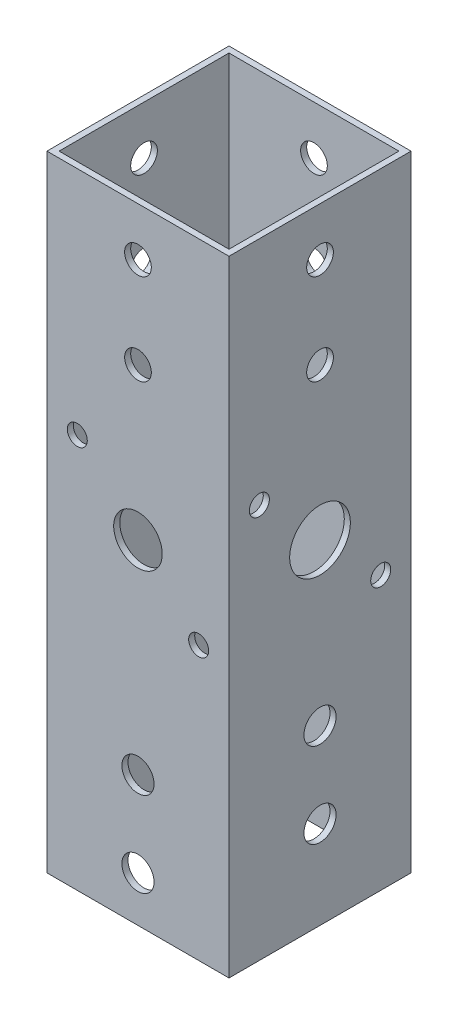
ISO-10303-21;
HEADER;
FILE_DESCRIPTION(('STEP AP214'),'2;1');
FILE_NAME('part.step','',(''),(''),'','','');
FILE_SCHEMA(('AUTOMOTIVE_DESIGN { 1 0 10303 214 1 1 1 1 }'));
ENDSEC;
DATA;
#1=APPLICATION_CONTEXT('core data for automotive mechanical design processes');
#2=APPLICATION_PROTOCOL_DEFINITION('international standard','automotive_design',2000,#1);
#3=PRODUCT_CONTEXT('',#1,'mechanical');
#4=PRODUCT('Part','Part','',(#3));
#5=PRODUCT_RELATED_PRODUCT_CATEGORY('part','',(#4));
#6=PRODUCT_DEFINITION_FORMATION('','',#4);
#7=PRODUCT_DEFINITION_CONTEXT('part definition',#1,'design');
#8=PRODUCT_DEFINITION('design','',#6,#7);
#9=PRODUCT_DEFINITION_SHAPE('','',#8);
#10=(LENGTH_UNIT() NAMED_UNIT(*) SI_UNIT(.MILLI.,.METRE.));
#11=(NAMED_UNIT(*) PLANE_ANGLE_UNIT() SI_UNIT($,.RADIAN.));
#12=(NAMED_UNIT(*) SI_UNIT($,.STERADIAN.) SOLID_ANGLE_UNIT());
#13=UNCERTAINTY_MEASURE_WITH_UNIT(LENGTH_MEASURE(1.E-05),#10,'distance_accuracy_value','');
#14=(GEOMETRIC_REPRESENTATION_CONTEXT(3) GLOBAL_UNCERTAINTY_ASSIGNED_CONTEXT((#13)) GLOBAL_UNIT_ASSIGNED_CONTEXT((#10,
#11,#12)) REPRESENTATION_CONTEXT('',''));
#15=CARTESIAN_POINT('',(0.,0.,0.));
#16=DIRECTION('',(0.,0.,1.));
#17=DIRECTION('',(1.,0.,0.));
#18=AXIS2_PLACEMENT_3D('',#15,#16,#17);
#19=CARTESIAN_POINT('',(0.,-3.,0.));
#20=DIRECTION('',(0.,1.,0.));
#21=DIRECTION('',(1.,0.,0.));
#22=AXIS2_PLACEMENT_3D('',#19,#20,#21);
#23=PLANE('',#22);
#24=DIRECTION('',(0.,0.,1.));
#25=VECTOR('',#24,1.);
#26=CARTESIAN_POINT('',(14.,-3.,-14.));
#27=LINE('',#26,#25);
#28=CARTESIAN_POINT('',(14.,-3.,-14.));
#29=VERTEX_POINT('',#28);
#30=CARTESIAN_POINT('',(14.,-3.,14.));
#31=VERTEX_POINT('',#30);
#32=EDGE_CURVE('E208',#29,#31,#27,.T.);
#33=ORIENTED_EDGE('',*,*,#32,.F.);
#34=DIRECTION('',(1.,0.,0.));
#35=VECTOR('',#34,1.);
#36=CARTESIAN_POINT('',(-14.,-3.,-14.));
#37=LINE('',#36,#35);
#38=CARTESIAN_POINT('',(-14.,-3.,-14.));
#39=VERTEX_POINT('',#38);
#40=EDGE_CURVE('E49',#39,#29,#37,.T.);
#41=ORIENTED_EDGE('',*,*,#40,.F.);
#42=DIRECTION('',(0.,0.,-1.));
#43=VECTOR('',#42,1.);
#44=CARTESIAN_POINT('',(-14.,-3.,-14.));
#45=LINE('',#44,#43);
#46=CARTESIAN_POINT('',(-14.,-3.,14.));
#47=VERTEX_POINT('',#46);
#48=EDGE_CURVE('E224',#47,#39,#45,.T.);
#49=ORIENTED_EDGE('',*,*,#48,.F.);
#50=DIRECTION('',(-1.,0.,0.));
#51=VECTOR('',#50,1.);
#52=CARTESIAN_POINT('',(-14.,-3.,14.));
#53=LINE('',#52,#51);
#54=EDGE_CURVE('E25',#31,#47,#53,.T.);
#55=ORIENTED_EDGE('',*,*,#54,.F.);
#56=EDGE_LOOP('',(#33,#41,#49,#55));
#57=FACE_BOUND('',#56,.T.);
#58=DIRECTION('',(0.,0.,1.));
#59=VECTOR('',#58,1.);
#60=CARTESIAN_POINT('',(15.,-3.,-15.));
#61=LINE('',#60,#59);
#62=CARTESIAN_POINT('',(15.,-3.,-15.));
#63=VERTEX_POINT('',#62);
#64=CARTESIAN_POINT('',(15.,-3.,15.));
#65=VERTEX_POINT('',#64);
#66=EDGE_CURVE('E112',#63,#65,#61,.T.);
#67=ORIENTED_EDGE('',*,*,#66,.T.);
#68=DIRECTION('',(-1.,0.,0.));
#69=VECTOR('',#68,1.);
#70=CARTESIAN_POINT('',(-15.,-3.,15.));
#71=LINE('',#70,#69);
#72=CARTESIAN_POINT('',(-15.,-3.,15.));
#73=VERTEX_POINT('',#72);
#74=EDGE_CURVE('E106',#65,#73,#71,.T.);
#75=ORIENTED_EDGE('',*,*,#74,.T.);
#76=DIRECTION('',(0.,0.,-1.));
#77=VECTOR('',#76,1.);
#78=CARTESIAN_POINT('',(-15.,-3.,-15.));
#79=LINE('',#78,#77);
#80=CARTESIAN_POINT('',(-15.,-3.,-15.));
#81=VERTEX_POINT('',#80);
#82=EDGE_CURVE('E109',#73,#81,#79,.T.);
#83=ORIENTED_EDGE('',*,*,#82,.T.);
#84=DIRECTION('',(1.,0.,0.));
#85=VECTOR('',#84,1.);
#86=CARTESIAN_POINT('',(-15.,-3.,-15.));
#87=LINE('',#86,#85);
#88=EDGE_CURVE('E235',#81,#63,#87,.T.);
#89=ORIENTED_EDGE('',*,*,#88,.T.);
#90=EDGE_LOOP('',(#67,#75,#83,#89));
#91=FACE_BOUND('',#90,.T.);
#92=ADVANCED_FACE('F17',(#57,#91),#23,.F.);
#93=CARTESIAN_POINT('',(0.,100.,0.));
#94=DIRECTION('',(0.,-1.,0.));
#95=DIRECTION('',(0.,0.,-1.));
#96=AXIS2_PLACEMENT_3D('',#93,#94,#95);
#97=PLANE('',#96);
#98=DIRECTION('',(0.,0.,-1.));
#99=VECTOR('',#98,1.);
#100=CARTESIAN_POINT('',(14.,100.,14.));
#101=LINE('',#100,#99);
#102=CARTESIAN_POINT('',(14.,100.,14.));
#103=VERTEX_POINT('',#102);
#104=CARTESIAN_POINT('',(14.,100.,-14.));
#105=VERTEX_POINT('',#104);
#106=EDGE_CURVE('E216',#103,#105,#101,.T.);
#107=ORIENTED_EDGE('',*,*,#106,.F.);
#108=DIRECTION('',(1.,0.,0.));
#109=VECTOR('',#108,1.);
#110=CARTESIAN_POINT('',(-14.,100.,14.));
#111=LINE('',#110,#109);
#112=CARTESIAN_POINT('',(-14.,100.,14.));
#113=VERTEX_POINT('',#112);
#114=EDGE_CURVE('E11',#113,#103,#111,.T.);
#115=ORIENTED_EDGE('',*,*,#114,.F.);
#116=DIRECTION('',(0.,0.,1.));
#117=VECTOR('',#116,1.);
#118=CARTESIAN_POINT('',(-14.,100.,14.));
#119=LINE('',#118,#117);
#120=CARTESIAN_POINT('',(-14.,100.,-14.));
#121=VERTEX_POINT('',#120);
#122=EDGE_CURVE('E231',#121,#113,#119,.T.);
#123=ORIENTED_EDGE('',*,*,#122,.F.);
#124=DIRECTION('',(-1.,0.,0.));
#125=VECTOR('',#124,1.);
#126=CARTESIAN_POINT('',(-14.,100.,-14.));
#127=LINE('',#126,#125);
#128=EDGE_CURVE('E38',#105,#121,#127,.T.);
#129=ORIENTED_EDGE('',*,*,#128,.F.);
#130=EDGE_LOOP('',(#107,#115,#123,#129));
#131=FACE_BOUND('',#130,.T.);
#132=DIRECTION('',(0.,0.,-1.));
#133=VECTOR('',#132,1.);
#134=CARTESIAN_POINT('',(15.,100.,15.));
#135=LINE('',#134,#133);
#136=CARTESIAN_POINT('',(15.,100.,15.));
#137=VERTEX_POINT('',#136);
#138=CARTESIAN_POINT('',(15.,100.,-15.));
#139=VERTEX_POINT('',#138);
#140=EDGE_CURVE('E138',#137,#139,#135,.T.);
#141=ORIENTED_EDGE('',*,*,#140,.T.);
#142=DIRECTION('',(-1.,0.,0.));
#143=VECTOR('',#142,1.);
#144=CARTESIAN_POINT('',(-15.,100.,-15.));
#145=LINE('',#144,#143);
#146=CARTESIAN_POINT('',(-15.,100.,-15.));
#147=VERTEX_POINT('',#146);
#148=EDGE_CURVE('E118',#139,#147,#145,.T.);
#149=ORIENTED_EDGE('',*,*,#148,.T.);
#150=DIRECTION('',(0.,0.,1.));
#151=VECTOR('',#150,1.);
#152=CARTESIAN_POINT('',(-15.,100.,15.));
#153=LINE('',#152,#151);
#154=CARTESIAN_POINT('',(-15.,100.,15.));
#155=VERTEX_POINT('',#154);
#156=EDGE_CURVE('E127',#147,#155,#153,.T.);
#157=ORIENTED_EDGE('',*,*,#156,.T.);
#158=DIRECTION('',(1.,0.,0.));
#159=VECTOR('',#158,1.);
#160=CARTESIAN_POINT('',(-15.,100.,15.));
#161=LINE('',#160,#159);
#162=EDGE_CURVE('E117',#155,#137,#161,.T.);
#163=ORIENTED_EDGE('',*,*,#162,.T.);
#164=EDGE_LOOP('',(#141,#149,#157,#163));
#165=FACE_BOUND('',#164,.T.);
#166=ADVANCED_FACE('F255',(#131,#165),#97,.F.);
#167=CARTESIAN_POINT('',(-14.,100.,14.));
#168=DIRECTION('',(0.,0.,-1.));
#169=DIRECTION('',(0.,-1.,0.));
#170=AXIS2_PLACEMENT_3D('',#167,#168,#169);
#171=PLANE('',#170);
#172=CARTESIAN_POINT('',(-10.,62.,14.));
#173=DIRECTION('',(0.,0.,-1.));
#174=DIRECTION('',(-1.,0.,0.));
#175=AXIS2_PLACEMENT_3D('',#172,#173,#174);
#176=CIRCLE('',#175,1.65);
#177=CARTESIAN_POINT('',(-11.65,62.,14.));
#178=VERTEX_POINT('',#177);
#179=EDGE_CURVE('E446',#178,#178,#176,.T.);
#180=ORIENTED_EDGE('',*,*,#179,.F.);
#181=EDGE_LOOP('',(#180));
#182=FACE_BOUND('',#181,.T.);
#183=CARTESIAN_POINT('',(0.,18.5,14.));
#184=DIRECTION('',(0.,0.,-1.));
#185=DIRECTION('',(-1.,0.,0.));
#186=AXIS2_PLACEMENT_3D('',#183,#184,#185);
#187=CIRCLE('',#186,2.65);
#188=CARTESIAN_POINT('',(-2.65,18.5,14.));
#189=VERTEX_POINT('',#188);
#190=EDGE_CURVE('E168',#189,#189,#187,.T.);
#191=ORIENTED_EDGE('',*,*,#190,.F.);
#192=EDGE_LOOP('',(#191));
#193=FACE_BOUND('',#192,.T.);
#194=CARTESIAN_POINT('',(0.,92.,14.));
#195=DIRECTION('',(0.,0.,-1.));
#196=DIRECTION('',(-1.,0.,0.));
#197=AXIS2_PLACEMENT_3D('',#194,#195,#196);
#198=CIRCLE('',#197,2.2);
#199=CARTESIAN_POINT('',(-2.2,92.,14.));
#200=VERTEX_POINT('',#199);
#201=EDGE_CURVE('E149',#200,#200,#198,.T.);
#202=ORIENTED_EDGE('',*,*,#201,.F.);
#203=EDGE_LOOP('',(#202));
#204=FACE_BOUND('',#203,.T.);
#205=CARTESIAN_POINT('',(0.,77.,14.));
#206=DIRECTION('',(0.,0.,-1.));
#207=DIRECTION('',(-1.,0.,0.));
#208=AXIS2_PLACEMENT_3D('',#205,#206,#207);
#209=CIRCLE('',#208,2.2);
#210=CARTESIAN_POINT('',(-2.2,77.,14.));
#211=VERTEX_POINT('',#210);
#212=EDGE_CURVE('E176',#211,#211,#209,.T.);
#213=ORIENTED_EDGE('',*,*,#212,.F.);
#214=EDGE_LOOP('',(#213));
#215=FACE_BOUND('',#214,.T.);
#216=CARTESIAN_POINT('',(0.,4.5,14.));
#217=DIRECTION('',(0.,0.,-1.));
#218=DIRECTION('',(-1.,0.,0.));
#219=AXIS2_PLACEMENT_3D('',#216,#217,#218);
#220=CIRCLE('',#219,2.65);
#221=CARTESIAN_POINT('',(-2.65,4.5,14.));
#222=VERTEX_POINT('',#221);
#223=EDGE_CURVE('E187',#222,#222,#220,.T.);
#224=ORIENTED_EDGE('',*,*,#223,.F.);
#225=EDGE_LOOP('',(#224));
#226=FACE_BOUND('',#225,.T.);
#227=CARTESIAN_POINT('',(10.,42.,14.));
#228=DIRECTION('',(0.,0.,1.));
#229=DIRECTION('',(-1.,0.,0.));
#230=AXIS2_PLACEMENT_3D('',#227,#228,#229);
#231=CIRCLE('',#230,1.65);
#232=CARTESIAN_POINT('',(8.35,42.,14.));
#233=VERTEX_POINT('',#232);
#234=EDGE_CURVE('E445',#233,#233,#231,.T.);
#235=ORIENTED_EDGE('',*,*,#234,.T.);
#236=EDGE_LOOP('',(#235));
#237=FACE_BOUND('',#236,.T.);
#238=CARTESIAN_POINT('',(0.,52.,14.));
#239=DIRECTION('',(0.,0.,-1.));
#240=DIRECTION('',(-1.,0.,0.));
#241=AXIS2_PLACEMENT_3D('',#238,#239,#240);
#242=CIRCLE('',#241,4.);
#243=CARTESIAN_POINT('',(-4.,52.,14.));
#244=VERTEX_POINT('',#243);
#245=EDGE_CURVE('E410',#244,#244,#242,.T.);
#246=ORIENTED_EDGE('',*,*,#245,.F.);
#247=EDGE_LOOP('',(#246));
#248=FACE_BOUND('',#247,.T.);
#249=DIRECTION('',(0.,-1.,0.));
#250=VECTOR('',#249,1.);
#251=CARTESIAN_POINT('',(14.,100.,14.));
#252=LINE('',#251,#250);
#253=EDGE_CURVE('E212',#103,#31,#252,.T.);
#254=ORIENTED_EDGE('',*,*,#253,.T.);
#255=ORIENTED_EDGE('',*,*,#54,.T.);
#256=DIRECTION('',(0.,-1.,0.));
#257=VECTOR('',#256,1.);
#258=CARTESIAN_POINT('',(-14.,100.,14.));
#259=LINE('',#258,#257);
#260=EDGE_CURVE('E220',#113,#47,#259,.T.);
#261=ORIENTED_EDGE('',*,*,#260,.F.);
#262=ORIENTED_EDGE('',*,*,#114,.T.);
#263=EDGE_LOOP('',(#254,#255,#261,#262));
#264=FACE_BOUND('',#263,.T.);
#265=ADVANCED_FACE('F248',(#182,#193,#204,#215,#226,#237,#248,#264),#171,.T.);
#266=CARTESIAN_POINT('',(-14.,100.,-14.));
#267=DIRECTION('',(0.,0.,1.));
#268=DIRECTION('',(1.,0.,0.));
#269=AXIS2_PLACEMENT_3D('',#266,#267,#268);
#270=PLANE('',#269);
#271=CARTESIAN_POINT('',(-10.,62.,-14.));
#272=DIRECTION('',(0.,0.,1.));
#273=DIRECTION('',(1.,0.,0.));
#274=AXIS2_PLACEMENT_3D('',#271,#272,#273);
#275=CIRCLE('',#274,1.65);
#276=CARTESIAN_POINT('',(-8.35,62.,-14.));
#277=VERTEX_POINT('',#276);
#278=EDGE_CURVE('E450',#277,#277,#275,.T.);
#279=ORIENTED_EDGE('',*,*,#278,.F.);
#280=EDGE_LOOP('',(#279));
#281=FACE_BOUND('',#280,.T.);
#282=CARTESIAN_POINT('',(0.,18.5,-14.));
#283=DIRECTION('',(0.,0.,1.));
#284=DIRECTION('',(1.,0.,0.));
#285=AXIS2_PLACEMENT_3D('',#282,#283,#284);
#286=CIRCLE('',#285,2.65);
#287=CARTESIAN_POINT('',(2.65,18.5,-14.));
#288=VERTEX_POINT('',#287);
#289=EDGE_CURVE('E192',#288,#288,#286,.T.);
#290=ORIENTED_EDGE('',*,*,#289,.F.);
#291=EDGE_LOOP('',(#290));
#292=FACE_BOUND('',#291,.T.);
#293=CARTESIAN_POINT('',(0.,92.,-14.));
#294=DIRECTION('',(0.,0.,1.));
#295=DIRECTION('',(1.,0.,0.));
#296=AXIS2_PLACEMENT_3D('',#293,#294,#295);
#297=CIRCLE('',#296,2.2);
#298=CARTESIAN_POINT('',(2.2,92.,-14.));
#299=VERTEX_POINT('',#298);
#300=EDGE_CURVE('E177',#299,#299,#297,.T.);
#301=ORIENTED_EDGE('',*,*,#300,.F.);
#302=EDGE_LOOP('',(#301));
#303=FACE_BOUND('',#302,.T.);
#304=CARTESIAN_POINT('',(0.,77.,-14.));
#305=DIRECTION('',(0.,0.,1.));
#306=DIRECTION('',(1.,0.,0.));
#307=AXIS2_PLACEMENT_3D('',#304,#305,#306);
#308=CIRCLE('',#307,2.2);
#309=CARTESIAN_POINT('',(2.2,77.,-14.));
#310=VERTEX_POINT('',#309);
#311=EDGE_CURVE('E335',#310,#310,#308,.T.);
#312=ORIENTED_EDGE('',*,*,#311,.F.);
#313=EDGE_LOOP('',(#312));
#314=FACE_BOUND('',#313,.T.);
#315=CARTESIAN_POINT('',(0.,4.5,-14.));
#316=DIRECTION('',(0.,0.,1.));
#317=DIRECTION('',(1.,0.,0.));
#318=AXIS2_PLACEMENT_3D('',#315,#316,#317);
#319=CIRCLE('',#318,2.65);
#320=CARTESIAN_POINT('',(2.65,4.5,-14.));
#321=VERTEX_POINT('',#320);
#322=EDGE_CURVE('E162',#321,#321,#319,.T.);
#323=ORIENTED_EDGE('',*,*,#322,.F.);
#324=EDGE_LOOP('',(#323));
#325=FACE_BOUND('',#324,.T.);
#326=CARTESIAN_POINT('',(10.,42.,-14.));
#327=DIRECTION('',(0.,0.,-1.));
#328=DIRECTION('',(1.,0.,0.));
#329=AXIS2_PLACEMENT_3D('',#326,#327,#328);
#330=CIRCLE('',#329,1.65);
#331=CARTESIAN_POINT('',(11.65,42.,-14.));
#332=VERTEX_POINT('',#331);
#333=EDGE_CURVE('E449',#332,#332,#330,.T.);
#334=ORIENTED_EDGE('',*,*,#333,.T.);
#335=EDGE_LOOP('',(#334));
#336=FACE_BOUND('',#335,.T.);
#337=DIRECTION('',(0.,-1.,0.));
#338=VECTOR('',#337,1.);
#339=CARTESIAN_POINT('',(-14.,100.,-14.));
#340=LINE('',#339,#338);
#341=EDGE_CURVE('E228',#121,#39,#340,.T.);
#342=ORIENTED_EDGE('',*,*,#341,.T.);
#343=ORIENTED_EDGE('',*,*,#40,.T.);
#344=DIRECTION('',(0.,-1.,0.));
#345=VECTOR('',#344,1.);
#346=CARTESIAN_POINT('',(14.,100.,-14.));
#347=LINE('',#346,#345);
#348=EDGE_CURVE('E204',#105,#29,#347,.T.);
#349=ORIENTED_EDGE('',*,*,#348,.F.);
#350=ORIENTED_EDGE('',*,*,#128,.T.);
#351=EDGE_LOOP('',(#342,#343,#349,#350));
#352=FACE_BOUND('',#351,.T.);
#353=ADVANCED_FACE('F259',(#281,#292,#303,#314,#325,#336,#352),#270,.T.);
#354=CARTESIAN_POINT('',(-15.,100.,15.));
#355=DIRECTION('',(0.,0.,-1.));
#356=DIRECTION('',(0.,-1.,0.));
#357=AXIS2_PLACEMENT_3D('',#354,#355,#356);
#358=PLANE('',#357);
#359=CARTESIAN_POINT('',(-10.,62.,15.));
#360=DIRECTION('',(0.,0.,1.));
#361=DIRECTION('',(1.,0.,0.));
#362=AXIS2_PLACEMENT_3D('',#359,#360,#361);
#363=CIRCLE('',#362,1.65);
#364=CARTESIAN_POINT('',(-8.35,62.,15.));
#365=VERTEX_POINT('',#364);
#366=EDGE_CURVE('E441',#365,#365,#363,.T.);
#367=ORIENTED_EDGE('',*,*,#366,.F.);
#368=EDGE_LOOP('',(#367));
#369=FACE_BOUND('',#368,.T.);
#370=CARTESIAN_POINT('',(10.,42.,15.));
#371=DIRECTION('',(0.,0.,-1.));
#372=DIRECTION('',(1.,0.,0.));
#373=AXIS2_PLACEMENT_3D('',#370,#371,#372);
#374=CIRCLE('',#373,1.65);
#375=CARTESIAN_POINT('',(11.65,42.,15.));
#376=VERTEX_POINT('',#375);
#377=EDGE_CURVE('E358',#376,#376,#374,.T.);
#378=ORIENTED_EDGE('',*,*,#377,.T.);
#379=EDGE_LOOP('',(#378));
#380=FACE_BOUND('',#379,.T.);
#381=CARTESIAN_POINT('',(0.,4.5,15.));
#382=DIRECTION('',(0.,0.,1.));
#383=DIRECTION('',(1.,0.,0.));
#384=AXIS2_PLACEMENT_3D('',#381,#382,#383);
#385=CIRCLE('',#384,2.65);
#386=CARTESIAN_POINT('',(2.65,4.5,15.));
#387=VERTEX_POINT('',#386);
#388=EDGE_CURVE('E191',#387,#387,#385,.T.);
#389=ORIENTED_EDGE('',*,*,#388,.F.);
#390=EDGE_LOOP('',(#389));
#391=FACE_BOUND('',#390,.T.);
#392=CARTESIAN_POINT('',(0.,77.,15.));
#393=DIRECTION('',(0.,0.,1.));
#394=DIRECTION('',(1.,0.,0.));
#395=AXIS2_PLACEMENT_3D('',#392,#393,#394);
#396=CIRCLE('',#395,2.2);
#397=CARTESIAN_POINT('',(2.2,77.,15.));
#398=VERTEX_POINT('',#397);
#399=EDGE_CURVE('E154',#398,#398,#396,.T.);
#400=ORIENTED_EDGE('',*,*,#399,.F.);
#401=EDGE_LOOP('',(#400));
#402=FACE_BOUND('',#401,.T.);
#403=CARTESIAN_POINT('',(0.,92.,15.));
#404=DIRECTION('',(0.,0.,1.));
#405=DIRECTION('',(1.,0.,0.));
#406=AXIS2_PLACEMENT_3D('',#403,#404,#405);
#407=CIRCLE('',#406,2.2);
#408=CARTESIAN_POINT('',(2.2,92.,15.));
#409=VERTEX_POINT('',#408);
#410=EDGE_CURVE('E153',#409,#409,#407,.T.);
#411=ORIENTED_EDGE('',*,*,#410,.F.);
#412=EDGE_LOOP('',(#411));
#413=FACE_BOUND('',#412,.T.);
#414=CARTESIAN_POINT('',(0.,18.5,15.));
#415=DIRECTION('',(0.,0.,1.));
#416=DIRECTION('',(1.,0.,0.));
#417=AXIS2_PLACEMENT_3D('',#414,#415,#416);
#418=CIRCLE('',#417,2.65);
#419=CARTESIAN_POINT('',(2.65,18.5,15.));
#420=VERTEX_POINT('',#419);
#421=EDGE_CURVE('E163',#420,#420,#418,.T.);
#422=ORIENTED_EDGE('',*,*,#421,.F.);
#423=EDGE_LOOP('',(#422));
#424=FACE_BOUND('',#423,.T.);
#425=CARTESIAN_POINT('',(0.,52.,15.));
#426=DIRECTION('',(0.,0.,1.));
#427=DIRECTION('',(1.,0.,0.));
#428=AXIS2_PLACEMENT_3D('',#425,#426,#427);
#429=CIRCLE('',#428,4.);
#430=CARTESIAN_POINT('',(4.,52.,15.));
#431=VERTEX_POINT('',#430);
#432=EDGE_CURVE('E418',#431,#431,#429,.T.);
#433=ORIENTED_EDGE('',*,*,#432,.F.);
#434=EDGE_LOOP('',(#433));
#435=FACE_BOUND('',#434,.T.);
#436=DIRECTION('',(0.,-1.,0.));
#437=VECTOR('',#436,1.);
#438=CARTESIAN_POINT('',(-15.,100.,15.));
#439=LINE('',#438,#437);
#440=EDGE_CURVE('E121',#155,#73,#439,.T.);
#441=ORIENTED_EDGE('',*,*,#440,.T.);
#442=ORIENTED_EDGE('',*,*,#74,.F.);
#443=DIRECTION('',(0.,-1.,0.));
#444=VECTOR('',#443,1.);
#445=CARTESIAN_POINT('',(15.,100.,15.));
#446=LINE('',#445,#444);
#447=EDGE_CURVE('E167',#137,#65,#446,.T.);
#448=ORIENTED_EDGE('',*,*,#447,.F.);
#449=ORIENTED_EDGE('',*,*,#162,.F.);
#450=EDGE_LOOP('',(#441,#442,#448,#449));
#451=FACE_BOUND('',#450,.T.);
#452=ADVANCED_FACE('F122',(#369,#380,#391,#402,#413,#424,#435,#451),#358,.F.);
#453=CARTESIAN_POINT('',(-15.,100.,-15.));
#454=DIRECTION('',(0.,0.,1.));
#455=DIRECTION('',(1.,0.,0.));
#456=AXIS2_PLACEMENT_3D('',#453,#454,#455);
#457=PLANE('',#456);
#458=CARTESIAN_POINT('',(-10.,62.,-15.));
#459=DIRECTION('',(0.,0.,1.));
#460=DIRECTION('',(1.,0.,0.));
#461=AXIS2_PLACEMENT_3D('',#458,#459,#460);
#462=CIRCLE('',#461,1.65);
#463=CARTESIAN_POINT('',(-8.35,62.,-15.));
#464=VERTEX_POINT('',#463);
#465=EDGE_CURVE('E302',#464,#464,#462,.T.);
#466=ORIENTED_EDGE('',*,*,#465,.T.);
#467=EDGE_LOOP('',(#466));
#468=FACE_BOUND('',#467,.T.);
#469=CARTESIAN_POINT('',(10.,42.,-15.));
#470=DIRECTION('',(0.,0.,-1.));
#471=DIRECTION('',(1.,0.,0.));
#472=AXIS2_PLACEMENT_3D('',#469,#470,#471);
#473=CIRCLE('',#472,1.65);
#474=CARTESIAN_POINT('',(11.65,42.,-15.));
#475=VERTEX_POINT('',#474);
#476=EDGE_CURVE('E306',#475,#475,#473,.T.);
#477=ORIENTED_EDGE('',*,*,#476,.F.);
#478=EDGE_LOOP('',(#477));
#479=FACE_BOUND('',#478,.T.);
#480=CARTESIAN_POINT('',(0.,4.5,-15.));
#481=DIRECTION('',(0.,0.,1.));
#482=DIRECTION('',(1.,0.,0.));
#483=AXIS2_PLACEMENT_3D('',#480,#481,#482);
#484=CIRCLE('',#483,2.65);
#485=CARTESIAN_POINT('',(2.65,4.5,-15.));
#486=VERTEX_POINT('',#485);
#487=EDGE_CURVE('E158',#486,#486,#484,.T.);
#488=ORIENTED_EDGE('',*,*,#487,.T.);
#489=EDGE_LOOP('',(#488));
#490=FACE_BOUND('',#489,.T.);
#491=CARTESIAN_POINT('',(0.,77.,-15.));
#492=DIRECTION('',(0.,0.,1.));
#493=DIRECTION('',(1.,0.,0.));
#494=AXIS2_PLACEMENT_3D('',#491,#492,#493);
#495=CIRCLE('',#494,2.2);
#496=CARTESIAN_POINT('',(2.2,77.,-15.));
#497=VERTEX_POINT('',#496);
#498=EDGE_CURVE('E172',#497,#497,#495,.T.);
#499=ORIENTED_EDGE('',*,*,#498,.T.);
#500=EDGE_LOOP('',(#499));
#501=FACE_BOUND('',#500,.T.);
#502=CARTESIAN_POINT('',(0.,92.,-15.));
#503=DIRECTION('',(0.,0.,1.));
#504=DIRECTION('',(1.,0.,0.));
#505=AXIS2_PLACEMENT_3D('',#502,#503,#504);
#506=CIRCLE('',#505,2.2);
#507=CARTESIAN_POINT('',(2.2,92.,-15.));
#508=VERTEX_POINT('',#507);
#509=EDGE_CURVE('E182',#508,#508,#506,.T.);
#510=ORIENTED_EDGE('',*,*,#509,.T.);
#511=EDGE_LOOP('',(#510));
#512=FACE_BOUND('',#511,.T.);
#513=CARTESIAN_POINT('',(0.,18.5,-15.));
#514=DIRECTION('',(0.,0.,1.));
#515=DIRECTION('',(1.,0.,0.));
#516=AXIS2_PLACEMENT_3D('',#513,#514,#515);
#517=CIRCLE('',#516,2.65);
#518=CARTESIAN_POINT('',(2.65,18.5,-15.));
#519=VERTEX_POINT('',#518);
#520=EDGE_CURVE('E181',#519,#519,#517,.T.);
#521=ORIENTED_EDGE('',*,*,#520,.T.);
#522=EDGE_LOOP('',(#521));
#523=FACE_BOUND('',#522,.T.);
#524=DIRECTION('',(0.,-1.,0.));
#525=VECTOR('',#524,1.);
#526=CARTESIAN_POINT('',(15.,100.,-15.));
#527=LINE('',#526,#525);
#528=EDGE_CURVE('E186',#139,#63,#527,.T.);
#529=ORIENTED_EDGE('',*,*,#528,.T.);
#530=ORIENTED_EDGE('',*,*,#88,.F.);
#531=DIRECTION('',(0.,-1.,0.));
#532=VECTOR('',#531,1.);
#533=CARTESIAN_POINT('',(-15.,100.,-15.));
#534=LINE('',#533,#532);
#535=EDGE_CURVE('E131',#147,#81,#534,.T.);
#536=ORIENTED_EDGE('',*,*,#535,.F.);
#537=ORIENTED_EDGE('',*,*,#148,.F.);
#538=EDGE_LOOP('',(#529,#530,#536,#537));
#539=FACE_BOUND('',#538,.T.);
#540=ADVANCED_FACE('F268',(#468,#479,#490,#501,#512,#523,#539),#457,.F.);
#541=CARTESIAN_POINT('',(-14.,100.,14.));
#542=DIRECTION('',(1.,0.,0.));
#543=DIRECTION('',(0.,1.,0.));
#544=AXIS2_PLACEMENT_3D('',#541,#542,#543);
#545=PLANE('',#544);
#546=CARTESIAN_POINT('',(-14.,62.,10.));
#547=DIRECTION('',(1.,0.,0.));
#548=DIRECTION('',(0.,0.,-1.));
#549=AXIS2_PLACEMENT_3D('',#546,#547,#548);
#550=CIRCLE('',#549,1.65);
#551=CARTESIAN_POINT('',(-14.,62.,8.35));
#552=VERTEX_POINT('',#551);
#553=EDGE_CURVE('E430',#552,#552,#550,.T.);
#554=ORIENTED_EDGE('',*,*,#553,.F.);
#555=EDGE_LOOP('',(#554));
#556=FACE_BOUND('',#555,.T.);
#557=CARTESIAN_POINT('',(-14.,25.5,0.));
#558=DIRECTION('',(1.,0.,0.));
#559=DIRECTION('',(0.,0.,-1.));
#560=AXIS2_PLACEMENT_3D('',#557,#558,#559);
#561=CIRCLE('',#560,2.65);
#562=CARTESIAN_POINT('',(-14.,25.5,-2.65));
#563=VERTEX_POINT('',#562);
#564=EDGE_CURVE('E148',#563,#563,#561,.T.);
#565=ORIENTED_EDGE('',*,*,#564,.F.);
#566=EDGE_LOOP('',(#565));
#567=FACE_BOUND('',#566,.T.);
#568=CARTESIAN_POINT('',(-14.,92.,0.));
#569=DIRECTION('',(1.,0.,0.));
#570=DIRECTION('',(0.,0.,-1.));
#571=AXIS2_PLACEMENT_3D('',#568,#569,#570);
#572=CIRCLE('',#571,2.2);
#573=CARTESIAN_POINT('',(-14.,92.,-2.2));
#574=VERTEX_POINT('',#573);
#575=EDGE_CURVE('E142',#574,#574,#572,.T.);
#576=ORIENTED_EDGE('',*,*,#575,.F.);
#577=EDGE_LOOP('',(#576));
#578=FACE_BOUND('',#577,.T.);
#579=CARTESIAN_POINT('',(-14.,77.,0.));
#580=DIRECTION('',(1.,0.,0.));
#581=DIRECTION('',(0.,0.,-1.));
#582=AXIS2_PLACEMENT_3D('',#579,#580,#581);
#583=CIRCLE('',#582,2.2);
#584=CARTESIAN_POINT('',(-14.,77.,-2.2));
#585=VERTEX_POINT('',#584);
#586=EDGE_CURVE('E340',#585,#585,#583,.T.);
#587=ORIENTED_EDGE('',*,*,#586,.F.);
#588=EDGE_LOOP('',(#587));
#589=FACE_BOUND('',#588,.T.);
#590=CARTESIAN_POINT('',(-14.,11.5,0.));
#591=DIRECTION('',(1.,0.,0.));
#592=DIRECTION('',(0.,0.,-1.));
#593=AXIS2_PLACEMENT_3D('',#590,#591,#592);
#594=CIRCLE('',#593,2.65);
#595=CARTESIAN_POINT('',(-14.,11.5,-2.65));
#596=VERTEX_POINT('',#595);
#597=EDGE_CURVE('E329',#596,#596,#594,.T.);
#598=ORIENTED_EDGE('',*,*,#597,.F.);
#599=EDGE_LOOP('',(#598));
#600=FACE_BOUND('',#599,.T.);
#601=CARTESIAN_POINT('',(-14.,42.,-10.));
#602=DIRECTION('',(-1.,0.,0.));
#603=DIRECTION('',(0.,0.,-1.));
#604=AXIS2_PLACEMENT_3D('',#601,#602,#603);
#605=CIRCLE('',#604,1.65);
#606=CARTESIAN_POINT('',(-14.,42.,-11.65));
#607=VERTEX_POINT('',#606);
#608=EDGE_CURVE('E465',#607,#607,#605,.T.);
#609=ORIENTED_EDGE('',*,*,#608,.T.);
#610=EDGE_LOOP('',(#609));
#611=FACE_BOUND('',#610,.T.);
#612=ORIENTED_EDGE('',*,*,#260,.T.);
#613=ORIENTED_EDGE('',*,*,#48,.T.);
#614=ORIENTED_EDGE('',*,*,#341,.F.);
#615=ORIENTED_EDGE('',*,*,#122,.T.);
#616=EDGE_LOOP('',(#612,#613,#614,#615));
#617=FACE_BOUND('',#616,.T.);
#618=ADVANCED_FACE('F252',(#556,#567,#578,#589,#600,#611,#617),#545,.T.);
#619=CARTESIAN_POINT('',(14.,100.,14.));
#620=DIRECTION('',(-1.,0.,0.));
#621=DIRECTION('',(0.,0.,1.));
#622=AXIS2_PLACEMENT_3D('',#619,#620,#621);
#623=PLANE('',#622);
#624=CARTESIAN_POINT('',(14.,62.,10.));
#625=DIRECTION('',(-1.,0.,0.));
#626=DIRECTION('',(0.,0.,1.));
#627=AXIS2_PLACEMENT_3D('',#624,#625,#626);
#628=CIRCLE('',#627,1.65);
#629=CARTESIAN_POINT('',(14.,62.,11.65));
#630=VERTEX_POINT('',#629);
#631=EDGE_CURVE('E433',#630,#630,#628,.T.);
#632=ORIENTED_EDGE('',*,*,#631,.F.);
#633=EDGE_LOOP('',(#632));
#634=FACE_BOUND('',#633,.T.);
#635=CARTESIAN_POINT('',(14.,25.5,0.));
#636=DIRECTION('',(-1.,0.,0.));
#637=DIRECTION('',(0.,0.,1.));
#638=AXIS2_PLACEMENT_3D('',#635,#636,#637);
#639=CIRCLE('',#638,2.65);
#640=CARTESIAN_POINT('',(14.,25.5,2.65));
#641=VERTEX_POINT('',#640);
#642=EDGE_CURVE('E372',#641,#641,#639,.T.);
#643=ORIENTED_EDGE('',*,*,#642,.F.);
#644=EDGE_LOOP('',(#643));
#645=FACE_BOUND('',#644,.T.);
#646=CARTESIAN_POINT('',(14.,92.,0.));
#647=DIRECTION('',(-1.,0.,0.));
#648=DIRECTION('',(0.,0.,1.));
#649=AXIS2_PLACEMENT_3D('',#646,#647,#648);
#650=CIRCLE('',#649,2.2);
#651=CARTESIAN_POINT('',(14.,92.,2.2));
#652=VERTEX_POINT('',#651);
#653=EDGE_CURVE('E385',#652,#652,#650,.T.);
#654=ORIENTED_EDGE('',*,*,#653,.F.);
#655=EDGE_LOOP('',(#654));
#656=FACE_BOUND('',#655,.T.);
#657=CARTESIAN_POINT('',(14.,77.,0.));
#658=DIRECTION('',(-1.,0.,0.));
#659=DIRECTION('',(0.,0.,1.));
#660=AXIS2_PLACEMENT_3D('',#657,#658,#659);
#661=CIRCLE('',#660,2.2);
#662=CARTESIAN_POINT('',(14.,77.,2.2));
#663=VERTEX_POINT('',#662);
#664=EDGE_CURVE('E368',#663,#663,#661,.T.);
#665=ORIENTED_EDGE('',*,*,#664,.F.);
#666=EDGE_LOOP('',(#665));
#667=FACE_BOUND('',#666,.T.);
#668=CARTESIAN_POINT('',(14.,11.5,0.));
#669=DIRECTION('',(-1.,0.,0.));
#670=DIRECTION('',(0.,0.,1.));
#671=AXIS2_PLACEMENT_3D('',#668,#669,#670);
#672=CIRCLE('',#671,2.65);
#673=CARTESIAN_POINT('',(14.,11.5,2.65));
#674=VERTEX_POINT('',#673);
#675=EDGE_CURVE('E360',#674,#674,#672,.T.);
#676=ORIENTED_EDGE('',*,*,#675,.F.);
#677=EDGE_LOOP('',(#676));
#678=FACE_BOUND('',#677,.T.);
#679=CARTESIAN_POINT('',(14.,42.,-10.));
#680=DIRECTION('',(1.,0.,0.));
#681=DIRECTION('',(0.,0.,1.));
#682=AXIS2_PLACEMENT_3D('',#679,#680,#681);
#683=CIRCLE('',#682,1.65);
#684=CARTESIAN_POINT('',(14.,42.,-8.35));
#685=VERTEX_POINT('',#684);
#686=EDGE_CURVE('E451',#685,#685,#683,.T.);
#687=ORIENTED_EDGE('',*,*,#686,.T.);
#688=EDGE_LOOP('',(#687));
#689=FACE_BOUND('',#688,.T.);
#690=CARTESIAN_POINT('',(14.,52.,0.));
#691=DIRECTION('',(-1.,0.,0.));
#692=DIRECTION('',(0.,0.,1.));
#693=AXIS2_PLACEMENT_3D('',#690,#691,#692);
#694=CIRCLE('',#693,5.);
#695=CARTESIAN_POINT('',(14.,52.,5.));
#696=VERTEX_POINT('',#695);
#697=EDGE_CURVE('E411',#696,#696,#694,.T.);
#698=ORIENTED_EDGE('',*,*,#697,.F.);
#699=EDGE_LOOP('',(#698));
#700=FACE_BOUND('',#699,.T.);
#701=ORIENTED_EDGE('',*,*,#348,.T.);
#702=ORIENTED_EDGE('',*,*,#32,.T.);
#703=ORIENTED_EDGE('',*,*,#253,.F.);
#704=ORIENTED_EDGE('',*,*,#106,.T.);
#705=EDGE_LOOP('',(#701,#702,#703,#704));
#706=FACE_BOUND('',#705,.T.);
#707=ADVANCED_FACE('F258',(#634,#645,#656,#667,#678,#689,#700,#706),#623,.T.);
#708=CARTESIAN_POINT('',(-15.,100.,15.));
#709=DIRECTION('',(1.,0.,0.));
#710=DIRECTION('',(0.,1.,0.));
#711=AXIS2_PLACEMENT_3D('',#708,#709,#710);
#712=PLANE('',#711);
#713=CARTESIAN_POINT('',(-15.,62.,10.));
#714=DIRECTION('',(1.,0.,0.));
#715=DIRECTION('',(0.,0.,-1.));
#716=AXIS2_PLACEMENT_3D('',#713,#714,#715);
#717=CIRCLE('',#716,1.65);
#718=CARTESIAN_POINT('',(-15.,62.,8.35));
#719=VERTEX_POINT('',#718);
#720=EDGE_CURVE('E427',#719,#719,#717,.T.);
#721=ORIENTED_EDGE('',*,*,#720,.T.);
#722=EDGE_LOOP('',(#721));
#723=FACE_BOUND('',#722,.T.);
#724=CARTESIAN_POINT('',(-15.,42.,-10.));
#725=DIRECTION('',(-1.,0.,0.));
#726=DIRECTION('',(0.,0.,1.));
#727=AXIS2_PLACEMENT_3D('',#724,#725,#726);
#728=CIRCLE('',#727,1.65);
#729=CARTESIAN_POINT('',(-15.,42.,-8.35));
#730=VERTEX_POINT('',#729);
#731=EDGE_CURVE('E461',#730,#730,#728,.T.);
#732=ORIENTED_EDGE('',*,*,#731,.F.);
#733=EDGE_LOOP('',(#732));
#734=FACE_BOUND('',#733,.T.);
#735=CARTESIAN_POINT('',(-15.,11.5,0.));
#736=DIRECTION('',(1.,0.,0.));
#737=DIRECTION('',(0.,0.,-1.));
#738=AXIS2_PLACEMENT_3D('',#735,#736,#737);
#739=CIRCLE('',#738,2.65);
#740=CARTESIAN_POINT('',(-15.,11.5,-2.65));
#741=VERTEX_POINT('',#740);
#742=EDGE_CURVE('E334',#741,#741,#739,.T.);
#743=ORIENTED_EDGE('',*,*,#742,.T.);
#744=EDGE_LOOP('',(#743));
#745=FACE_BOUND('',#744,.T.);
#746=CARTESIAN_POINT('',(-15.,77.,0.));
#747=DIRECTION('',(1.,0.,0.));
#748=DIRECTION('',(0.,0.,-1.));
#749=AXIS2_PLACEMENT_3D('',#746,#747,#748);
#750=CIRCLE('',#749,2.2);
#751=CARTESIAN_POINT('',(-15.,77.,-2.2));
#752=VERTEX_POINT('',#751);
#753=EDGE_CURVE('E333',#752,#752,#750,.T.);
#754=ORIENTED_EDGE('',*,*,#753,.T.);
#755=EDGE_LOOP('',(#754));
#756=FACE_BOUND('',#755,.T.);
#757=CARTESIAN_POINT('',(-15.,92.,0.));
#758=DIRECTION('',(1.,0.,0.));
#759=DIRECTION('',(0.,0.,-1.));
#760=AXIS2_PLACEMENT_3D('',#757,#758,#759);
#761=CIRCLE('',#760,2.2);
#762=CARTESIAN_POINT('',(-15.,92.,-2.2));
#763=VERTEX_POINT('',#762);
#764=EDGE_CURVE('E347',#763,#763,#761,.T.);
#765=ORIENTED_EDGE('',*,*,#764,.T.);
#766=EDGE_LOOP('',(#765));
#767=FACE_BOUND('',#766,.T.);
#768=CARTESIAN_POINT('',(-15.,25.5,0.));
#769=DIRECTION('',(1.,0.,0.));
#770=DIRECTION('',(0.,0.,-1.));
#771=AXIS2_PLACEMENT_3D('',#768,#769,#770);
#772=CIRCLE('',#771,2.65);
#773=CARTESIAN_POINT('',(-15.,25.5,-2.65));
#774=VERTEX_POINT('',#773);
#775=EDGE_CURVE('E144',#774,#774,#772,.T.);
#776=ORIENTED_EDGE('',*,*,#775,.T.);
#777=EDGE_LOOP('',(#776));
#778=FACE_BOUND('',#777,.T.);
#779=ORIENTED_EDGE('',*,*,#535,.T.);
#780=ORIENTED_EDGE('',*,*,#82,.F.);
#781=ORIENTED_EDGE('',*,*,#440,.F.);
#782=ORIENTED_EDGE('',*,*,#156,.F.);
#783=EDGE_LOOP('',(#779,#780,#781,#782));
#784=FACE_BOUND('',#783,.T.);
#785=ADVANCED_FACE('F129',(#723,#734,#745,#756,#767,#778,#784),#712,.F.);
#786=CARTESIAN_POINT('',(15.,100.,15.));
#787=DIRECTION('',(-1.,0.,0.));
#788=DIRECTION('',(0.,0.,1.));
#789=AXIS2_PLACEMENT_3D('',#786,#787,#788);
#790=PLANE('',#789);
#791=CARTESIAN_POINT('',(15.,62.,10.));
#792=DIRECTION('',(1.,0.,0.));
#793=DIRECTION('',(0.,0.,-1.));
#794=AXIS2_PLACEMENT_3D('',#791,#792,#793);
#795=CIRCLE('',#794,1.65);
#796=CARTESIAN_POINT('',(15.,62.,8.35));
#797=VERTEX_POINT('',#796);
#798=EDGE_CURVE('E437',#797,#797,#795,.T.);
#799=ORIENTED_EDGE('',*,*,#798,.F.);
#800=EDGE_LOOP('',(#799));
#801=FACE_BOUND('',#800,.T.);
#802=CARTESIAN_POINT('',(15.,42.,-10.));
#803=DIRECTION('',(-1.,0.,0.));
#804=DIRECTION('',(0.,0.,1.));
#805=AXIS2_PLACEMENT_3D('',#802,#803,#804);
#806=CIRCLE('',#805,1.65);
#807=CARTESIAN_POINT('',(15.,42.,-8.35));
#808=VERTEX_POINT('',#807);
#809=EDGE_CURVE('E431',#808,#808,#806,.T.);
#810=ORIENTED_EDGE('',*,*,#809,.T.);
#811=EDGE_LOOP('',(#810));
#812=FACE_BOUND('',#811,.T.);
#813=CARTESIAN_POINT('',(15.,11.5,0.));
#814=DIRECTION('',(1.,0.,0.));
#815=DIRECTION('',(0.,0.,-1.));
#816=AXIS2_PLACEMENT_3D('',#813,#814,#815);
#817=CIRCLE('',#816,2.65);
#818=CARTESIAN_POINT('',(15.,11.5,-2.65));
#819=VERTEX_POINT('',#818);
#820=EDGE_CURVE('E364',#819,#819,#817,.T.);
#821=ORIENTED_EDGE('',*,*,#820,.F.);
#822=EDGE_LOOP('',(#821));
#823=FACE_BOUND('',#822,.T.);
#824=CARTESIAN_POINT('',(15.,77.,0.));
#825=DIRECTION('',(1.,0.,0.));
#826=DIRECTION('',(0.,0.,-1.));
#827=AXIS2_PLACEMENT_3D('',#824,#825,#826);
#828=CIRCLE('',#827,2.2);
#829=CARTESIAN_POINT('',(15.,77.,-2.2));
#830=VERTEX_POINT('',#829);
#831=EDGE_CURVE('E381',#830,#830,#828,.T.);
#832=ORIENTED_EDGE('',*,*,#831,.F.);
#833=EDGE_LOOP('',(#832));
#834=FACE_BOUND('',#833,.T.);
#835=CARTESIAN_POINT('',(15.,92.,0.));
#836=DIRECTION('',(1.,0.,0.));
#837=DIRECTION('',(0.,0.,-1.));
#838=AXIS2_PLACEMENT_3D('',#835,#836,#837);
#839=CIRCLE('',#838,2.2);
#840=CARTESIAN_POINT('',(15.,92.,-2.2));
#841=VERTEX_POINT('',#840);
#842=EDGE_CURVE('E377',#841,#841,#839,.T.);
#843=ORIENTED_EDGE('',*,*,#842,.F.);
#844=EDGE_LOOP('',(#843));
#845=FACE_BOUND('',#844,.T.);
#846=CARTESIAN_POINT('',(15.,25.5,0.));
#847=DIRECTION('',(1.,0.,0.));
#848=DIRECTION('',(0.,0.,-1.));
#849=AXIS2_PLACEMENT_3D('',#846,#847,#848);
#850=CIRCLE('',#849,2.65);
#851=CARTESIAN_POINT('',(15.,25.5,-2.65));
#852=VERTEX_POINT('',#851);
#853=EDGE_CURVE('E376',#852,#852,#850,.T.);
#854=ORIENTED_EDGE('',*,*,#853,.F.);
#855=EDGE_LOOP('',(#854));
#856=FACE_BOUND('',#855,.T.);
#857=CARTESIAN_POINT('',(15.,52.,0.));
#858=DIRECTION('',(1.,0.,0.));
#859=DIRECTION('',(0.,0.,-1.));
#860=AXIS2_PLACEMENT_3D('',#857,#858,#859);
#861=CIRCLE('',#860,5.);
#862=CARTESIAN_POINT('',(15.,52.,-5.));
#863=VERTEX_POINT('',#862);
#864=EDGE_CURVE('E407',#863,#863,#861,.T.);
#865=ORIENTED_EDGE('',*,*,#864,.F.);
#866=EDGE_LOOP('',(#865));
#867=FACE_BOUND('',#866,.T.);
#868=ORIENTED_EDGE('',*,*,#447,.T.);
#869=ORIENTED_EDGE('',*,*,#66,.F.);
#870=ORIENTED_EDGE('',*,*,#528,.F.);
#871=ORIENTED_EDGE('',*,*,#140,.F.);
#872=EDGE_LOOP('',(#868,#869,#870,#871));
#873=FACE_BOUND('',#872,.T.);
#874=ADVANCED_FACE('F287',(#801,#812,#823,#834,#845,#856,#867,#873),#790,.F.);
#875=CARTESIAN_POINT('',(0.,18.5,-15.));
#876=DIRECTION('',(0.,0.,1.));
#877=DIRECTION('',(1.,0.,0.));
#878=AXIS2_PLACEMENT_3D('',#875,#876,#877);
#879=CYLINDRICAL_SURFACE('',#878,2.65);
#880=ORIENTED_EDGE('',*,*,#421,.T.);
#881=EDGE_LOOP('',(#880));
#882=FACE_BOUND('',#881,.T.);
#883=ORIENTED_EDGE('',*,*,#190,.T.);
#884=EDGE_LOOP('',(#883));
#885=FACE_BOUND('',#884,.T.);
#886=ADVANCED_FACE('F399',(#882,#885),#879,.F.);
#887=CARTESIAN_POINT('',(0.,92.,-15.));
#888=DIRECTION('',(0.,0.,1.));
#889=DIRECTION('',(1.,0.,0.));
#890=AXIS2_PLACEMENT_3D('',#887,#888,#889);
#891=CYLINDRICAL_SURFACE('',#890,2.2);
#892=ORIENTED_EDGE('',*,*,#410,.T.);
#893=EDGE_LOOP('',(#892));
#894=FACE_BOUND('',#893,.T.);
#895=ORIENTED_EDGE('',*,*,#201,.T.);
#896=EDGE_LOOP('',(#895));
#897=FACE_BOUND('',#896,.T.);
#898=ADVANCED_FACE('F283',(#894,#897),#891,.F.);
#899=CARTESIAN_POINT('',(0.,77.,-15.));
#900=DIRECTION('',(0.,0.,1.));
#901=DIRECTION('',(1.,0.,0.));
#902=AXIS2_PLACEMENT_3D('',#899,#900,#901);
#903=CYLINDRICAL_SURFACE('',#902,2.2);
#904=ORIENTED_EDGE('',*,*,#399,.T.);
#905=EDGE_LOOP('',(#904));
#906=FACE_BOUND('',#905,.T.);
#907=ORIENTED_EDGE('',*,*,#212,.T.);
#908=EDGE_LOOP('',(#907));
#909=FACE_BOUND('',#908,.T.);
#910=ADVANCED_FACE('F597',(#906,#909),#903,.F.);
#911=CARTESIAN_POINT('',(0.,4.5,-15.));
#912=DIRECTION('',(0.,0.,1.));
#913=DIRECTION('',(1.,0.,0.));
#914=AXIS2_PLACEMENT_3D('',#911,#912,#913);
#915=CYLINDRICAL_SURFACE('',#914,2.65);
#916=ORIENTED_EDGE('',*,*,#388,.T.);
#917=EDGE_LOOP('',(#916));
#918=FACE_BOUND('',#917,.T.);
#919=ORIENTED_EDGE('',*,*,#223,.T.);
#920=EDGE_LOOP('',(#919));
#921=FACE_BOUND('',#920,.T.);
#922=ADVANCED_FACE('F594',(#918,#921),#915,.F.);
#923=CARTESIAN_POINT('',(0.,18.5,-15.));
#924=DIRECTION('',(0.,0.,1.));
#925=DIRECTION('',(1.,0.,0.));
#926=AXIS2_PLACEMENT_3D('',#923,#924,#925);
#927=CYLINDRICAL_SURFACE('',#926,2.65);
#928=ORIENTED_EDGE('',*,*,#289,.T.);
#929=EDGE_LOOP('',(#928));
#930=FACE_BOUND('',#929,.T.);
#931=ORIENTED_EDGE('',*,*,#520,.F.);
#932=EDGE_LOOP('',(#931));
#933=FACE_BOUND('',#932,.T.);
#934=ADVANCED_FACE('F590',(#930,#933),#927,.F.);
#935=CARTESIAN_POINT('',(0.,92.,-15.));
#936=DIRECTION('',(0.,0.,1.));
#937=DIRECTION('',(1.,0.,0.));
#938=AXIS2_PLACEMENT_3D('',#935,#936,#937);
#939=CYLINDRICAL_SURFACE('',#938,2.2);
#940=ORIENTED_EDGE('',*,*,#300,.T.);
#941=EDGE_LOOP('',(#940));
#942=FACE_BOUND('',#941,.T.);
#943=ORIENTED_EDGE('',*,*,#509,.F.);
#944=EDGE_LOOP('',(#943));
#945=FACE_BOUND('',#944,.T.);
#946=ADVANCED_FACE('F586',(#942,#945),#939,.F.);
#947=CARTESIAN_POINT('',(0.,77.,-15.));
#948=DIRECTION('',(0.,0.,1.));
#949=DIRECTION('',(1.,0.,0.));
#950=AXIS2_PLACEMENT_3D('',#947,#948,#949);
#951=CYLINDRICAL_SURFACE('',#950,2.2);
#952=ORIENTED_EDGE('',*,*,#311,.T.);
#953=EDGE_LOOP('',(#952));
#954=FACE_BOUND('',#953,.T.);
#955=ORIENTED_EDGE('',*,*,#498,.F.);
#956=EDGE_LOOP('',(#955));
#957=FACE_BOUND('',#956,.T.);
#958=ADVANCED_FACE('F582',(#954,#957),#951,.F.);
#959=CARTESIAN_POINT('',(0.,4.5,-15.));
#960=DIRECTION('',(0.,0.,1.));
#961=DIRECTION('',(1.,0.,0.));
#962=AXIS2_PLACEMENT_3D('',#959,#960,#961);
#963=CYLINDRICAL_SURFACE('',#962,2.65);
#964=ORIENTED_EDGE('',*,*,#322,.T.);
#965=EDGE_LOOP('',(#964));
#966=FACE_BOUND('',#965,.T.);
#967=ORIENTED_EDGE('',*,*,#487,.F.);
#968=EDGE_LOOP('',(#967));
#969=FACE_BOUND('',#968,.T.);
#970=ADVANCED_FACE('F578',(#966,#969),#963,.F.);
#971=CARTESIAN_POINT('',(-15.,25.5,0.));
#972=DIRECTION('',(1.,0.,0.));
#973=DIRECTION('',(0.,0.,-1.));
#974=AXIS2_PLACEMENT_3D('',#971,#972,#973);
#975=CYLINDRICAL_SURFACE('',#974,2.65);
#976=ORIENTED_EDGE('',*,*,#564,.T.);
#977=EDGE_LOOP('',(#976));
#978=FACE_BOUND('',#977,.T.);
#979=ORIENTED_EDGE('',*,*,#775,.F.);
#980=EDGE_LOOP('',(#979));
#981=FACE_BOUND('',#980,.T.);
#982=ADVANCED_FACE('F572',(#978,#981),#975,.F.);
#983=CARTESIAN_POINT('',(-15.,92.,0.));
#984=DIRECTION('',(1.,0.,0.));
#985=DIRECTION('',(0.,0.,-1.));
#986=AXIS2_PLACEMENT_3D('',#983,#984,#985);
#987=CYLINDRICAL_SURFACE('',#986,2.2);
#988=ORIENTED_EDGE('',*,*,#575,.T.);
#989=EDGE_LOOP('',(#988));
#990=FACE_BOUND('',#989,.T.);
#991=ORIENTED_EDGE('',*,*,#764,.F.);
#992=EDGE_LOOP('',(#991));
#993=FACE_BOUND('',#992,.T.);
#994=ADVANCED_FACE('F569',(#990,#993),#987,.F.);
#995=CARTESIAN_POINT('',(-15.,77.,0.));
#996=DIRECTION('',(1.,0.,0.));
#997=DIRECTION('',(0.,0.,-1.));
#998=AXIS2_PLACEMENT_3D('',#995,#996,#997);
#999=CYLINDRICAL_SURFACE('',#998,2.2);
#1000=ORIENTED_EDGE('',*,*,#586,.T.);
#1001=EDGE_LOOP('',(#1000));
#1002=FACE_BOUND('',#1001,.T.);
#1003=ORIENTED_EDGE('',*,*,#753,.F.);
#1004=EDGE_LOOP('',(#1003));
#1005=FACE_BOUND('',#1004,.T.);
#1006=ADVANCED_FACE('F567',(#1002,#1005),#999,.F.);
#1007=CARTESIAN_POINT('',(-15.,11.5,0.));
#1008=DIRECTION('',(1.,0.,0.));
#1009=DIRECTION('',(0.,0.,-1.));
#1010=AXIS2_PLACEMENT_3D('',#1007,#1008,#1009);
#1011=CYLINDRICAL_SURFACE('',#1010,2.65);
#1012=ORIENTED_EDGE('',*,*,#597,.T.);
#1013=EDGE_LOOP('',(#1012));
#1014=FACE_BOUND('',#1013,.T.);
#1015=ORIENTED_EDGE('',*,*,#742,.F.);
#1016=EDGE_LOOP('',(#1015));
#1017=FACE_BOUND('',#1016,.T.);
#1018=ADVANCED_FACE('F497',(#1014,#1017),#1011,.F.);
#1019=CARTESIAN_POINT('',(-15.,25.5,0.));
#1020=DIRECTION('',(1.,0.,0.));
#1021=DIRECTION('',(0.,0.,-1.));
#1022=AXIS2_PLACEMENT_3D('',#1019,#1020,#1021);
#1023=CYLINDRICAL_SURFACE('',#1022,2.65);
#1024=ORIENTED_EDGE('',*,*,#853,.T.);
#1025=EDGE_LOOP('',(#1024));
#1026=FACE_BOUND('',#1025,.T.);
#1027=ORIENTED_EDGE('',*,*,#642,.T.);
#1028=EDGE_LOOP('',(#1027));
#1029=FACE_BOUND('',#1028,.T.);
#1030=ADVANCED_FACE('F494',(#1026,#1029),#1023,.F.);
#1031=CARTESIAN_POINT('',(-15.,92.,0.));
#1032=DIRECTION('',(1.,0.,0.));
#1033=DIRECTION('',(0.,0.,-1.));
#1034=AXIS2_PLACEMENT_3D('',#1031,#1032,#1033);
#1035=CYLINDRICAL_SURFACE('',#1034,2.2);
#1036=ORIENTED_EDGE('',*,*,#842,.T.);
#1037=EDGE_LOOP('',(#1036));
#1038=FACE_BOUND('',#1037,.T.);
#1039=ORIENTED_EDGE('',*,*,#653,.T.);
#1040=EDGE_LOOP('',(#1039));
#1041=FACE_BOUND('',#1040,.T.);
#1042=ADVANCED_FACE('F394',(#1038,#1041),#1035,.F.);
#1043=CARTESIAN_POINT('',(-15.,77.,0.));
#1044=DIRECTION('',(1.,0.,0.));
#1045=DIRECTION('',(0.,0.,-1.));
#1046=AXIS2_PLACEMENT_3D('',#1043,#1044,#1045);
#1047=CYLINDRICAL_SURFACE('',#1046,2.2);
#1048=ORIENTED_EDGE('',*,*,#831,.T.);
#1049=EDGE_LOOP('',(#1048));
#1050=FACE_BOUND('',#1049,.T.);
#1051=ORIENTED_EDGE('',*,*,#664,.T.);
#1052=EDGE_LOOP('',(#1051));
#1053=FACE_BOUND('',#1052,.T.);
#1054=ADVANCED_FACE('F524',(#1050,#1053),#1047,.F.);
#1055=CARTESIAN_POINT('',(-15.,11.5,0.));
#1056=DIRECTION('',(1.,0.,0.));
#1057=DIRECTION('',(0.,0.,-1.));
#1058=AXIS2_PLACEMENT_3D('',#1055,#1056,#1057);
#1059=CYLINDRICAL_SURFACE('',#1058,2.65);
#1060=ORIENTED_EDGE('',*,*,#820,.T.);
#1061=EDGE_LOOP('',(#1060));
#1062=FACE_BOUND('',#1061,.T.);
#1063=ORIENTED_EDGE('',*,*,#675,.T.);
#1064=EDGE_LOOP('',(#1063));
#1065=FACE_BOUND('',#1064,.T.);
#1066=ADVANCED_FACE('F537',(#1062,#1065),#1059,.F.);
#1067=CARTESIAN_POINT('',(10.,42.,-15.));
#1068=DIRECTION('',(0.,0.,1.));
#1069=DIRECTION('',(1.,0.,0.));
#1070=AXIS2_PLACEMENT_3D('',#1067,#1068,#1069);
#1071=CYLINDRICAL_SURFACE('',#1070,1.65);
#1072=ORIENTED_EDGE('',*,*,#377,.F.);
#1073=EDGE_LOOP('',(#1072));
#1074=FACE_BOUND('',#1073,.T.);
#1075=ORIENTED_EDGE('',*,*,#234,.F.);
#1076=EDGE_LOOP('',(#1075));
#1077=FACE_BOUND('',#1076,.T.);
#1078=ADVANCED_FACE('F530',(#1074,#1077),#1071,.F.);
#1079=CARTESIAN_POINT('',(-10.,62.,-15.));
#1080=DIRECTION('',(0.,0.,1.));
#1081=DIRECTION('',(1.,0.,0.));
#1082=AXIS2_PLACEMENT_3D('',#1079,#1080,#1081);
#1083=CYLINDRICAL_SURFACE('',#1082,1.65);
#1084=ORIENTED_EDGE('',*,*,#366,.T.);
#1085=EDGE_LOOP('',(#1084));
#1086=FACE_BOUND('',#1085,.T.);
#1087=ORIENTED_EDGE('',*,*,#179,.T.);
#1088=EDGE_LOOP('',(#1087));
#1089=FACE_BOUND('',#1088,.T.);
#1090=ADVANCED_FACE('F527',(#1086,#1089),#1083,.F.);
#1091=CARTESIAN_POINT('',(10.,42.,-15.));
#1092=DIRECTION('',(0.,0.,1.));
#1093=DIRECTION('',(1.,0.,0.));
#1094=AXIS2_PLACEMENT_3D('',#1091,#1092,#1093);
#1095=CYLINDRICAL_SURFACE('',#1094,1.65);
#1096=ORIENTED_EDGE('',*,*,#333,.F.);
#1097=EDGE_LOOP('',(#1096));
#1098=FACE_BOUND('',#1097,.T.);
#1099=ORIENTED_EDGE('',*,*,#476,.T.);
#1100=EDGE_LOOP('',(#1099));
#1101=FACE_BOUND('',#1100,.T.);
#1102=ADVANCED_FACE('F529',(#1098,#1101),#1095,.F.);
#1103=CARTESIAN_POINT('',(-10.,62.,-15.));
#1104=DIRECTION('',(0.,0.,1.));
#1105=DIRECTION('',(1.,0.,0.));
#1106=AXIS2_PLACEMENT_3D('',#1103,#1104,#1105);
#1107=CYLINDRICAL_SURFACE('',#1106,1.65);
#1108=ORIENTED_EDGE('',*,*,#278,.T.);
#1109=EDGE_LOOP('',(#1108));
#1110=FACE_BOUND('',#1109,.T.);
#1111=ORIENTED_EDGE('',*,*,#465,.F.);
#1112=EDGE_LOOP('',(#1111));
#1113=FACE_BOUND('',#1112,.T.);
#1114=ADVANCED_FACE('F554',(#1110,#1113),#1107,.F.);
#1115=CARTESIAN_POINT('',(-15.,42.,-10.));
#1116=DIRECTION('',(1.,0.,0.));
#1117=DIRECTION('',(0.,0.,-1.));
#1118=AXIS2_PLACEMENT_3D('',#1115,#1116,#1117);
#1119=CYLINDRICAL_SURFACE('',#1118,1.65);
#1120=ORIENTED_EDGE('',*,*,#608,.F.);
#1121=EDGE_LOOP('',(#1120));
#1122=FACE_BOUND('',#1121,.T.);
#1123=ORIENTED_EDGE('',*,*,#731,.T.);
#1124=EDGE_LOOP('',(#1123));
#1125=FACE_BOUND('',#1124,.T.);
#1126=ADVANCED_FACE('F547',(#1122,#1125),#1119,.F.);
#1127=CARTESIAN_POINT('',(-15.,62.,10.));
#1128=DIRECTION('',(1.,0.,0.));
#1129=DIRECTION('',(0.,0.,-1.));
#1130=AXIS2_PLACEMENT_3D('',#1127,#1128,#1129);
#1131=CYLINDRICAL_SURFACE('',#1130,1.65);
#1132=ORIENTED_EDGE('',*,*,#553,.T.);
#1133=EDGE_LOOP('',(#1132));
#1134=FACE_BOUND('',#1133,.T.);
#1135=ORIENTED_EDGE('',*,*,#720,.F.);
#1136=EDGE_LOOP('',(#1135));
#1137=FACE_BOUND('',#1136,.T.);
#1138=ADVANCED_FACE('F543',(#1134,#1137),#1131,.F.);
#1139=CARTESIAN_POINT('',(-15.,42.,-10.));
#1140=DIRECTION('',(1.,0.,0.));
#1141=DIRECTION('',(0.,0.,-1.));
#1142=AXIS2_PLACEMENT_3D('',#1139,#1140,#1141);
#1143=CYLINDRICAL_SURFACE('',#1142,1.65);
#1144=ORIENTED_EDGE('',*,*,#809,.F.);
#1145=EDGE_LOOP('',(#1144));
#1146=FACE_BOUND('',#1145,.T.);
#1147=ORIENTED_EDGE('',*,*,#686,.F.);
#1148=EDGE_LOOP('',(#1147));
#1149=FACE_BOUND('',#1148,.T.);
#1150=ADVANCED_FACE('F535',(#1146,#1149),#1143,.F.);
#1151=CARTESIAN_POINT('',(-15.,62.,10.));
#1152=DIRECTION('',(1.,0.,0.));
#1153=DIRECTION('',(0.,0.,-1.));
#1154=AXIS2_PLACEMENT_3D('',#1151,#1152,#1153);
#1155=CYLINDRICAL_SURFACE('',#1154,1.65);
#1156=ORIENTED_EDGE('',*,*,#798,.T.);
#1157=EDGE_LOOP('',(#1156));
#1158=FACE_BOUND('',#1157,.T.);
#1159=ORIENTED_EDGE('',*,*,#631,.T.);
#1160=EDGE_LOOP('',(#1159));
#1161=FACE_BOUND('',#1160,.T.);
#1162=ADVANCED_FACE('F519',(#1158,#1161),#1155,.F.);
#1163=CARTESIAN_POINT('',(0.,52.,5.));
#1164=DIRECTION('',(0.,0.,1.));
#1165=DIRECTION('',(1.,0.,0.));
#1166=AXIS2_PLACEMENT_3D('',#1163,#1164,#1165);
#1167=CYLINDRICAL_SURFACE('',#1166,4.);
#1168=ORIENTED_EDGE('',*,*,#432,.T.);
#1169=EDGE_LOOP('',(#1168));
#1170=FACE_BOUND('',#1169,.T.);
#1171=ORIENTED_EDGE('',*,*,#245,.T.);
#1172=EDGE_LOOP('',(#1171));
#1173=FACE_BOUND('',#1172,.T.);
#1174=ADVANCED_FACE('F514',(#1170,#1173),#1167,.F.);
#1175=CARTESIAN_POINT('',(5.,52.,0.));
#1176=DIRECTION('',(1.,0.,0.));
#1177=DIRECTION('',(0.,0.,-1.));
#1178=AXIS2_PLACEMENT_3D('',#1175,#1176,#1177);
#1179=CYLINDRICAL_SURFACE('',#1178,5.);
#1180=ORIENTED_EDGE('',*,*,#864,.T.);
#1181=EDGE_LOOP('',(#1180));
#1182=FACE_BOUND('',#1181,.T.);
#1183=ORIENTED_EDGE('',*,*,#697,.T.);
#1184=EDGE_LOOP('',(#1183));
#1185=FACE_BOUND('',#1184,.T.);
#1186=ADVANCED_FACE('F512',(#1182,#1185),#1179,.F.);
#1187=CLOSED_SHELL('',(#92,#166,#265,#353,#452,#540,#618,#707,#785,#874,#886,#898,#910,#922,
#934,#946,#958,#970,#982,#994,#1006,#1018,#1030,#1042,#1054,#1066,#1078,#1090,#1102,#1114,#1126,
#1138,#1150,#1162,#1174,#1186));
#1188=MANIFOLD_SOLID_BREP('B1',#1187);
#1189=ADVANCED_BREP_SHAPE_REPRESENTATION('',(#18,#1188),#14);
#1190=SHAPE_DEFINITION_REPRESENTATION(#9,#1189);
ENDSEC;
END-ISO-10303-21;
